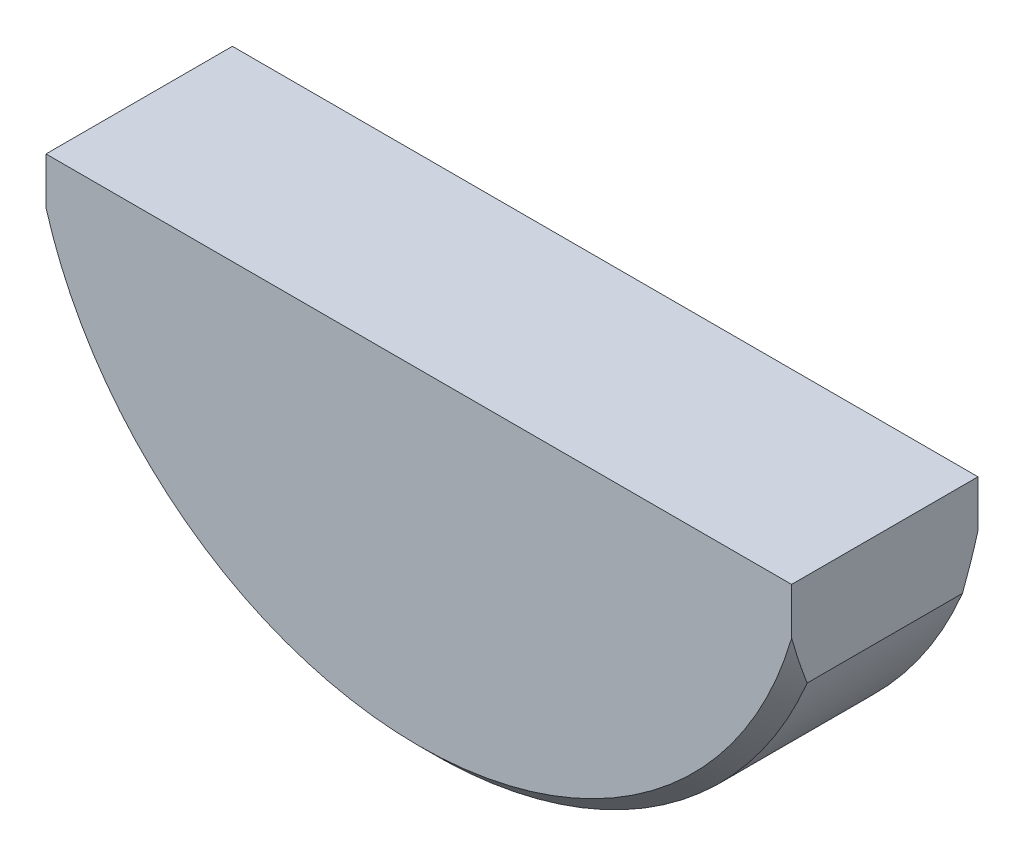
from build123d import *

# Parameters (mm, degrees)
BASE_EXTRUSION_DEPTH = 6
CHANFREIN1_SIZE      = 1


with BuildPart() as part:
    # Esquisse1 → Base-Extrusion (new, symmetric)
    with BuildSketch(Plane.XY):
        with BuildLine():
            Line((-24, 30), (-24, 24))
            ThreePointArc((-24, 24), (0, 8), (24, 24))
            Line((24, 24), (24, 30))
            Line((24, 30), (-24, 30))
        make_face()
    extrude(amount=BASE_EXTRUSION_DEPTH, both=True)

    # Chanfrein1
    chanfrein1_edges = [part.edges().sort_by_distance(p)[0] for p in [
        (0, 8, -6),
        (0, 8, 6),
    ]]
    chamfer(chanfrein1_edges, length=CHANFREIN1_SIZE)


solid = part.part
